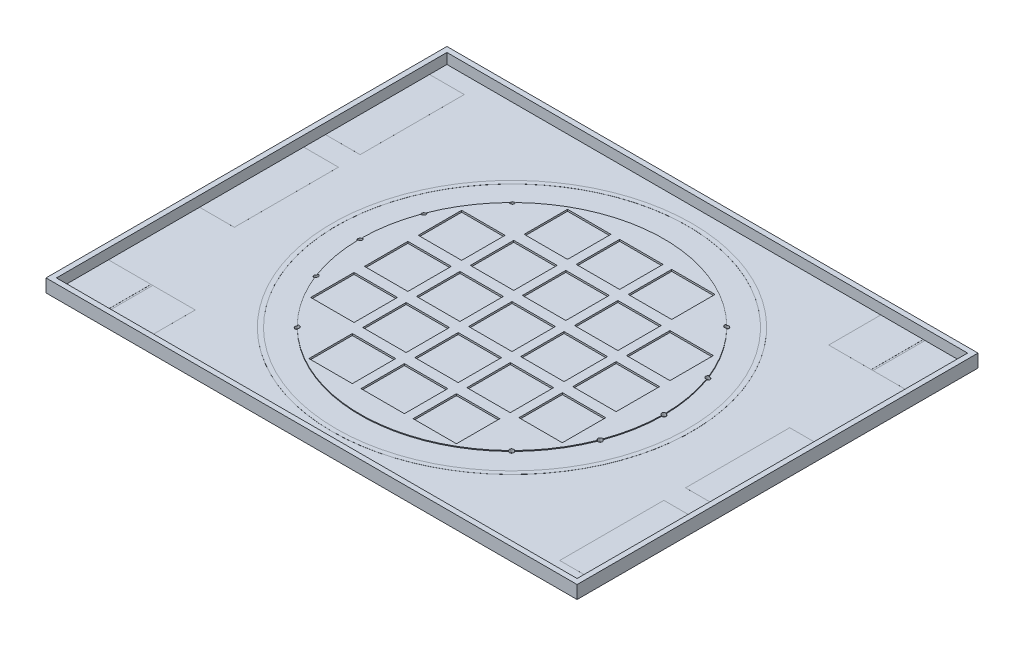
from build123d import *

# Parameters (mm, degrees)
SKETCH1_W           = 6120
SKETCH1_H           = 4620
BOSS_EXTRUDE1_DEPTH = 30
SKETCH2_W           = 6120
SKETCH2_H           = 4620
SKETCH2_W_2         = 6000
SKETCH2_H_2         = 4500
BOSS_EXTRUDE2_DEPTH = 120
SKETCH3_R           = 1750
BOSS_EXTRUDE3_DEPTH = 10
SKETCH4_W           = 500
SKETCH4_H           = 500
CUT_EXTRUDE1_DEPTH  = 20
SKETCH12_R          = 2075
SKETCH12_R_2        = 2025
BOSS_EXTRUDE8_DEPTH = 1
SKETCH13_W          = 1000
SKETCH13_H          = 600
SKETCH13_W_2        = 400
SKETCH13_H_2        = 1200
BOSS_EXTRUDE9_DEPTH = 0.1
SKETCH14_R          = 25
CUT_EXTRUDE2_DEPTH  = 40
SKETCH15_W          = 20
SKETCH15_H          = 600
CUT_EXTRUDE3_DEPTH  = 1


with BuildPart() as part:
    # Sketch1 → Boss-Extrude1 (new body)
    with BuildSketch(Plane(origin=(0, 0, 0), x_dir=(1, 0, 0), z_dir=(0, 1, 0))):
        Rectangle(SKETCH1_W, SKETCH1_H)
    extrude(amount=BOSS_EXTRUDE1_DEPTH)

    # Sketch2 → Boss-Extrude2 (add)
    with BuildSketch(Plane(origin=(0, 30, 0), x_dir=(1, 0, 0), z_dir=(0, 1, 0))):
        Rectangle(SKETCH2_W, SKETCH2_H)
        Rectangle(SKETCH2_W_2, SKETCH2_H_2, mode=Mode.SUBTRACT)
    extrude(amount=BOSS_EXTRUDE2_DEPTH)

    # Sketch3 → Boss-Extrude3 (add)
    with BuildSketch(Plane(origin=(0, 30, 0), x_dir=(1, 0, 0), z_dir=(0, 1, 0))):
        with Locations(Location((0, 0, 0), (0, 0, 270))):
            Circle(SKETCH3_R)
    extrude(amount=BOSS_EXTRUDE3_DEPTH)

    # Sketch4 → Cut-Extrude1 (cut)
    with BuildSketch(Plane(origin=(0, 40, 0), x_dir=(1, 0, 0), z_dir=(0, 1, 0))):
        with Locations((600, 0)):
            Rectangle(SKETCH4_W, SKETCH4_H)
        Rectangle(SKETCH4_W, SKETCH4_H)
        with Locations((1200, 0)):
            Rectangle(SKETCH4_W, SKETCH4_H)
        with Locations((-1200, 0)):
            Rectangle(SKETCH4_W, SKETCH4_H)
        with Locations((-600, 0)):
            Rectangle(SKETCH4_W, SKETCH4_H)
        with Locations((0, 620)):
            Rectangle(SKETCH4_W, SKETCH4_H)
        with Locations((-600, 620)):
            Rectangle(SKETCH4_W, SKETCH4_H)
        with Locations((600, 620)):
            Rectangle(SKETCH4_W, SKETCH4_H)
        with Locations((0, 1240)):
            Rectangle(SKETCH4_W, SKETCH4_H)
        with Locations((-600, 1240)):
            Rectangle(SKETCH4_W, SKETCH4_H)
        with Locations((600, 1240)):
            Rectangle(SKETCH4_W, SKETCH4_H)
        with Locations((600, -1240)):
            Rectangle(SKETCH4_W, SKETCH4_H)
        with Locations((-600, -1240)):
            Rectangle(SKETCH4_W, SKETCH4_H)
        with Locations((0, -1240)):
            Rectangle(SKETCH4_W, SKETCH4_H)
        with Locations((600, -620)):
            Rectangle(SKETCH4_W, SKETCH4_H)
        with Locations((-600, -620)):
            Rectangle(SKETCH4_W, SKETCH4_H)
        with Locations((0, -620)):
            Rectangle(SKETCH4_W, SKETCH4_H)
        with Locations((-1200, 620)):
            Rectangle(SKETCH4_W, SKETCH4_H)
        with Locations((1200, 620)):
            Rectangle(SKETCH4_W, SKETCH4_H)
        with Locations((1200, -620)):
            Rectangle(SKETCH4_W, SKETCH4_H)
        with Locations((-1200, -620)):
            Rectangle(SKETCH4_W, SKETCH4_H)
    extrude(amount=-CUT_EXTRUDE1_DEPTH, mode=Mode.SUBTRACT)

    # Sketch12 → Boss-Extrude8 (add)
    with BuildSketch(Plane(origin=(0, 30, 0), x_dir=(1, 0, 0), z_dir=(0, 1, 0))):
        with Locations(Location((0, 0, 0), (0, 0, 270))):
            Circle(SKETCH12_R)
        with Locations(Location((0, 0, 0), (0, 0, 270))):
            Circle(SKETCH12_R_2, mode=Mode.SUBTRACT)
    extrude(amount=BOSS_EXTRUDE8_DEPTH)

    # Sketch13 → Boss-Extrude9 (add)
    with BuildSketch(Plane(origin=(0, 30, 0), x_dir=(1, 0, 0), z_dir=(0, 1, 0))):
        with Locations((-2500, -1950)):
            Rectangle(SKETCH13_W, SKETCH13_H)
        with Locations((-2800, 0)):
            Rectangle(SKETCH13_W_2, SKETCH13_H_2)
        with Locations((-2800, 1450)):
            Rectangle(SKETCH13_W_2, SKETCH13_H_2)
        with Locations((2500, 1950)):
            Rectangle(SKETCH13_W, SKETCH13_H)
        with Locations((2800, 0)):
            Rectangle(SKETCH13_W_2, SKETCH13_H_2)
        with Locations((2800, -1450)):
            Rectangle(SKETCH13_W_2, SKETCH13_H_2)
    extrude(amount=BOSS_EXTRUDE9_DEPTH)

    # Sketch14 → Cut-Extrude2 (cut)
    with BuildSketch(Plane(origin=(0, 40, 0), x_dir=(1, 0, 0), z_dir=(0, 1, 0))):
        with Locations(Location((-1636.490146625, -620, 0), (0, 0, 270))):
            Circle(SKETCH14_R)
        with Locations(Location((-1234.868414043, -1240, 0), (0, 0, 270))):
            Circle(SKETCH14_R)
        with Locations(Location((-1750, 0, 0), (0, 0, 270))):
            Circle(SKETCH14_R)
        with Locations(Location((-1636.490146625, 620, 0), (0, 0, 270))):
            Circle(SKETCH14_R)
        with Locations(Location((-1234.868414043, 1240, 0), (0, 0, 270))):
            Circle(SKETCH14_R)
        with Locations(Location((1234.868414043, 1240, 0), (0, 0, 314.709542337))):
            Circle(SKETCH14_R)
        with Locations(Location((1636.490146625, 620, 0), (0, 0, 290.340414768))):
            Circle(SKETCH14_R)
        with Locations(Location((1750, 0, 0), (0, 0, 269.590740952))):
            Circle(SKETCH14_R)
        with Locations(Location((1234.868414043, -1240, 0), (0, 0, 224.471939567))):
            Circle(SKETCH14_R)
        with Locations(Location((1636.490146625, -620, 0), (0, 0, 248.841067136))):
            Circle(SKETCH14_R)
    extrude(amount=-CUT_EXTRUDE2_DEPTH, mode=Mode.SUBTRACT)

    # Sketch15 → Cut-Extrude3 (cut)
    with BuildSketch(Plane(origin=(0, 30.1, 0), x_dir=(1, 0, 0), z_dir=(0, 1, 0))):
        with Locations((-2500, -1950)):
            Rectangle(SKETCH15_W, SKETCH15_H)
        with Locations((2500, 1950)):
            Rectangle(SKETCH15_W, SKETCH15_H)
    extrude(amount=-CUT_EXTRUDE3_DEPTH, mode=Mode.SUBTRACT)


solid = part.part
